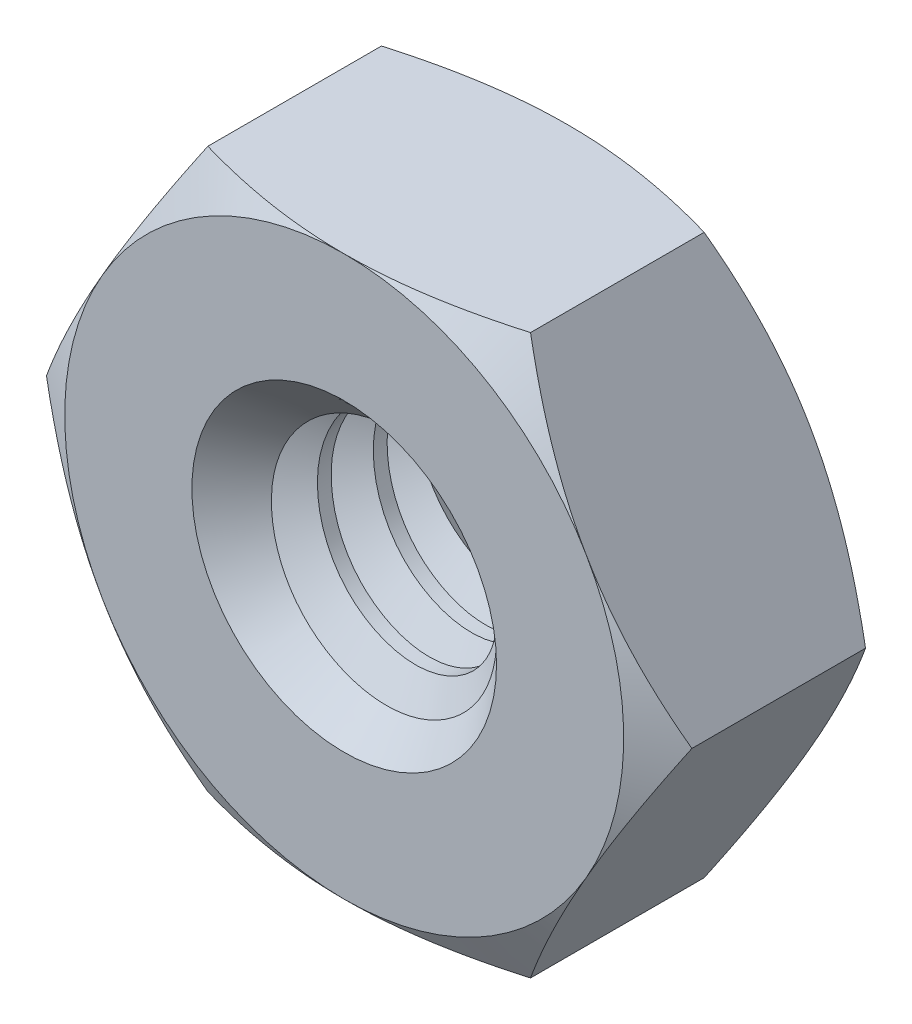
from build123d import *

# Parameters (mm, degrees)
Y_KSEKLIK_EKSTR_ZYON1_DEPTH = 1.6
IZIM2_OUTSIDE_W             = 13.423999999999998
IZIM2_OUTSIDE_H             = 12.806
IZIM2_OUTSIDE_R             = 2.0000000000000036
KES_EKSTR_ZYON1_DEPTH       = 1.6
KES_EKSTR_ZYON1_DRAFT       = -60.000000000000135
IZIM3_OUTSIDE_W             = 13.423999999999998
IZIM3_OUTSIDE_H             = 12.806
IZIM3_OUTSIDE_R             = 2.0000000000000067
KES_EKSTR_ZYON2_DEPTH       = 1.6
KES_EKSTR_ZYON2_DRAFT       = -60.000000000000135
IZIM4_R                     = 0.74
KES_EKSTR_ZYON3_DEPTH       = 1.6
PAH1_SIZE                   = 0.35


with BuildPart() as part:
    # izim1 → Y_kseklik-Ekstr_zyon1 (new body)
    with BuildSketch(Plane.XY):
        Polygon((2.309401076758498, -8.66e-15), (1.1547005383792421, 2.0000000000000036), (-1.1547005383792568, 2.0000000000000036), (-2.30940107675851, 1.51e-15), (-1.1547005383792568, -2), (1.1547005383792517, -1.9999999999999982), align=None)
    extrude(amount=Y_KSEKLIK_EKSTR_ZYON1_DEPTH)


with BuildPart() as kes_ekstr_zyon1_tool:
    # izim2 outside → Kes-Ekstr_zyon1 (with draft: the straight prism first)
    with BuildSketch(Plane.XY.offset(1.6)):
        Rectangle(IZIM2_OUTSIDE_W, IZIM2_OUTSIDE_H)
        Circle(IZIM2_OUTSIDE_R, mode=Mode.SUBTRACT)
    extrude(amount=-KES_EKSTR_ZYON1_DEPTH)
    # Kes-Ekstr_zyon1: the draft: its side faces are tilted about the plane it starts from
    kes_ekstr_zyon1_sides = [kes_ekstr_zyon1_tool.faces().sort_by_distance(p)[0] for p in [
        (0, -6.403, 0.8),
        (6.712, 0, 0.8),
        (0, 6.403, 0.8),
        (-6.712, 0, 0.8),
        (-2, 0, 0.8),
    ]]
    draft(kes_ekstr_zyon1_sides, Plane.XY.offset(1.6), KES_EKSTR_ZYON1_DRAFT)


with BuildPart() as part_1:
    add(part.part)

    # Kes-Ekstr_zyon1: cut by kes_ekstr_zyon1_tool
    add(kes_ekstr_zyon1_tool.part, mode=Mode.SUBTRACT)


with BuildPart() as kes_ekstr_zyon2_tool:
    # izim3 outside → Kes-Ekstr_zyon2 (with draft: the straight prism first)
    with BuildSketch(Plane(origin=(0, 0, 0), x_dir=(-1, 0, 0), z_dir=(0, 0, -1))):
        Rectangle(IZIM3_OUTSIDE_W, IZIM3_OUTSIDE_H)
        Circle(IZIM3_OUTSIDE_R, mode=Mode.SUBTRACT)
    extrude(amount=-KES_EKSTR_ZYON2_DEPTH)
    # Kes-Ekstr_zyon2: the draft: its side faces are tilted about the plane it starts from
    kes_ekstr_zyon2_sides = [kes_ekstr_zyon2_tool.faces().sort_by_distance(p)[0] for p in [
        (0, -6.403, 0.8),
        (-6.712, 0, 0.8),
        (0, 6.403, 0.8),
        (6.712, 0, 0.8),
        (2, 0, 0.8),
    ]]
    draft(kes_ekstr_zyon2_sides, Plane(origin=(0, 0, 0), x_dir=(-1, 0, 0), z_dir=(0, 0, -1)), KES_EKSTR_ZYON2_DRAFT)


with BuildPart() as part_2:
    add(part_1.part)

    # Kes-Ekstr_zyon2: cut by kes_ekstr_zyon2_tool
    add(kes_ekstr_zyon2_tool.part, mode=Mode.SUBTRACT)

    # izim4 → Kes-Ekstr_zyon3 (cut)
    with BuildSketch(Plane(origin=(0, 0, 0), x_dir=(-1, 0, 0), z_dir=(0, 0, -1))):
        Circle(IZIM4_R)
    extrude(amount=-KES_EKSTR_ZYON3_DEPTH, mode=Mode.SUBTRACT)

    # Pah1
    pah1_edges = [part_2.edges().sort_by_distance(p)[0] for p in [
        (0.74, -2.4e-16, 1.6),
        (0.74, -2.4e-16, 0),
    ]]
    chamfer(pah1_edges, length=PAH1_SIZE)

    # Kes-S_p_r1: sweep along a curve in space
    with BuildLine() as kes_s_p_r1_path:
        add(Edge.make_bspline(
            [(-0.74, -5.17e-15, 1.6), (-0.7400000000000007, 0.09624913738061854, 1.5917197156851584), (-0.7014695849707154, 0.2908383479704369, 1.574975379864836), (-0.5368815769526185, 0.5368065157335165, 1.5500065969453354), (-0.2905582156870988, 0.7014896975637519, 1.524998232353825), (-2.87e-15, 0.7592598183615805, 1.500000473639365), (0.29055821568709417, 0.7014710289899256, 1.4749998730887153), (0.5368815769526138, 0.5368811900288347, 1.450000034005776), (0.7014695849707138, 0.29055831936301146, 1.4249999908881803), (0.7592652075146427, -2.777987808e-08, 1.4000000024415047), (0.7014695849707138, -0.29055820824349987, 1.3749999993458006), (0.536881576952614, -0.5368815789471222, 1.350000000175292), (0.2905582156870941, -0.7014695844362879, 1.3249999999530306), (-2.68e-15, -0.759265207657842, 1.3000000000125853), (-0.2905582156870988, -0.7014695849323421, 1.2749999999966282), (-0.5368815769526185, -0.5368815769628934, 1.2500000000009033), (-0.7014695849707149, -0.2905582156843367, 1.2249999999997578), (-0.7592652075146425, -7.3226e-13, 1.200000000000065), (-0.7014695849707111, 0.2905582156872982, 1.1749999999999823), (-0.5368815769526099, 0.5368815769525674, 1.150000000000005), (-0.290558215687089, 0.7014695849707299, 1.1249999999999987), (7.19e-15, 0.7592652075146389, 1.1), (0.2905582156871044, 0.7014695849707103, 1.0749999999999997), (0.5368815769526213, 0.5368815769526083, 1.05), (0.7014695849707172, 0.29055821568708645, 1.0250000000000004), (0.7592652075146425, -1.071e-14, 1), (0.7014695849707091, -0.29055821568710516, 0.9750000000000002), (0.5368815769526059, -0.5368815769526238, 0.9499999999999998), (0.290558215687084, -0.7014695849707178, 0.9250000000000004), (-1.413e-14, -0.7592652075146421, 0.9000000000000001), (-0.2905582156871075, -0.701469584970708, 0.8750000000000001), (-0.5368815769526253, -0.5368815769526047, 0.8500000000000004), (-0.7014695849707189, -0.2905582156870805, 0.8250000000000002), (-0.7592652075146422, 1.51e-14, 0.8000000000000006), (-0.7014695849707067, 0.290558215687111, 0.7750000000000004), (-0.536881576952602, 0.5368815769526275, 0.7500000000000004), (-0.2905582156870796, 0.7014695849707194, 0.7250000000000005), (1.864e-14, 0.7592652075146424, 0.7000000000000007), (0.29055821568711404, 0.7014695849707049, 0.6750000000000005), (0.5368815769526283, 0.5368815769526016, 0.6500000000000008), (0.701469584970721, 0.2905582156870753, 0.6250000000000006), (0.7592652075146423, -1.938e-14, 0.6000000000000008), (0.7014695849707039, -0.29055821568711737, 0.5750000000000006), (0.5368815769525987, -0.5368815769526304, 0.5500000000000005), (0.2905582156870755, -0.701469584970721, 0.5250000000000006), (-2.562e-14, -0.7592652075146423, 0.5000000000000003), (-0.29055821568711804, -0.701469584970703, 0.47500000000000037), (-0.5368815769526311, -0.5368815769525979, 0.45000000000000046), (-0.7014695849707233, -0.29055821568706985, 0.4250000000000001), (-0.7592652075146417, 2.661e-14, 0.4000000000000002), (-0.7014695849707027, 0.29055821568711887, 0.3750000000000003), (-0.5368815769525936, 0.5368815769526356, 0.34999999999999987), (-0.2905582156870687, 0.7014695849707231, 0.32499999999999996), (2.746e-14, 0.7592652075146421, 0.3000000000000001), (0.29055821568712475, 0.7014695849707, 0.27499999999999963), (0.5368815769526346, 0.5368815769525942, 0.24999999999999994), (0.7014695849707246, 0.2905582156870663, 0.2249999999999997), (0.7592652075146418, -3.178e-14, 0.19999999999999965), (0.7014695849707, -0.29055821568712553, 0.17499999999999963), (0.536881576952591, -0.5368815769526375, 0.14999999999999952), (0.29055821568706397, -0.7014695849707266, 0.12499999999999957), (-3.453e-14, -0.7592652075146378, 0.09999999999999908), (-0.29055821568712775, -0.7014695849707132, 0.07500000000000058), (-0.5368815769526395, -0.5368815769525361, 0.04999999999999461), (-0.7014695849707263, -0.29055821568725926, 0.02500000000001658), (-0.7592652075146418, 7.7531e-13, -6.574e-14), (-0.7014695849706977, 0.29055821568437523, -0.02499999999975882), (-0.5368815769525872, 0.5368815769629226, -0.05000000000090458), (-0.2905582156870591, 0.7014695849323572, -0.07499999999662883), (3.97e-14, 0.7592652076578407, -0.10000000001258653), (0.2905582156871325, 0.7014695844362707, -0.12499999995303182), (0.5368815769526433, 0.5368815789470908, -0.1500000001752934), (0.7014695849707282, 0.290558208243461, -0.1749999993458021), (0.7592652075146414, 2.777983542e-08, -0.20000000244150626), (0.7014695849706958, -0.29055831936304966, -0.22499999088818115), (0.5368815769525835, -0.5368811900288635, -0.25000003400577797), (0.29055821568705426, -0.7014710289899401, -0.2749998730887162), (-4.485e-14, -0.7592598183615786, -0.3000004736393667), (-0.29055821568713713, -0.7014896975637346, -0.3249982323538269), (-0.5368815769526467, -0.5368065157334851, -0.35000659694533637), (-0.70146958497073, -0.29083834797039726, -0.3749753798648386), (-0.740000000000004, -0.09624913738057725, -0.39171971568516), (-0.739999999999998, 4.622e-14, -0.4000000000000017)],
            knots=[0, 0, 0, 0, 0.01250000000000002, 0.02500000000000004, 0.03750000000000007, 0.05000000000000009, 0.06250000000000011, 0.07500000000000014, 0.08750000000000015, 0.10000000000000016, 0.1125000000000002, 0.1250000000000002, 0.13750000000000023, 0.15000000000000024, 0.16250000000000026, 0.17500000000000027, 0.1875000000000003, 0.20000000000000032, 0.21250000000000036, 0.22500000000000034, 0.23750000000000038, 0.2500000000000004, 0.26250000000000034, 0.27500000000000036, 0.28750000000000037, 0.3000000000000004, 0.3125000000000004, 0.32500000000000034, 0.33750000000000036, 0.35000000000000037, 0.36250000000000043, 0.37500000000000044, 0.38750000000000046, 0.4000000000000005, 0.41250000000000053, 0.42500000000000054, 0.4375000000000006, 0.4500000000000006, 0.46250000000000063, 0.4750000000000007, 0.4875000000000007, 0.5000000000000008, 0.5125000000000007, 0.5250000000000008, 0.5375000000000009, 0.5500000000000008, 0.5625000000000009, 0.575000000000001, 0.5875000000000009, 0.600000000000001, 0.612500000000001, 0.625000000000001, 0.6375000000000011, 0.6500000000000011, 0.6625000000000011, 0.6750000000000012, 0.6875000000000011, 0.7000000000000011, 0.712500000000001, 0.725000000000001, 0.7375000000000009, 0.7500000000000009, 0.7625000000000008, 0.7750000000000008, 0.7875000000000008, 0.8000000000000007, 0.8125000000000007, 0.8250000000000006, 0.8375000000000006, 0.8500000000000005, 0.8625000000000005, 0.8750000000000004, 0.8875000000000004, 0.9000000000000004, 0.9125000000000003, 0.9250000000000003, 0.9375000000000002, 0.9500000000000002, 0.9625000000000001, 0.9750000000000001, 0.9875, 1, 1, 1, 1], degree=3))
    # izim6 → Kes-S_p_r1 (sweep, cut)
    with BuildSketch(Plane(origin=(-0.739999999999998, 4.622e-14, -0.40000000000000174), x_dir=(1, -6.15e-14, 5.29e-15), z_dir=(6.172696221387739e-14, 0.9963198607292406, -0.08571309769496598))):
        Polygon((0.07793178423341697, 0.19510500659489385), (0.07793178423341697, -0.1951050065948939), (-0.26, 0), align=None)
    sweep(path=kes_s_p_r1_path.line, is_frenet=True, mode=Mode.SUBTRACT)


solid = part_2.part
